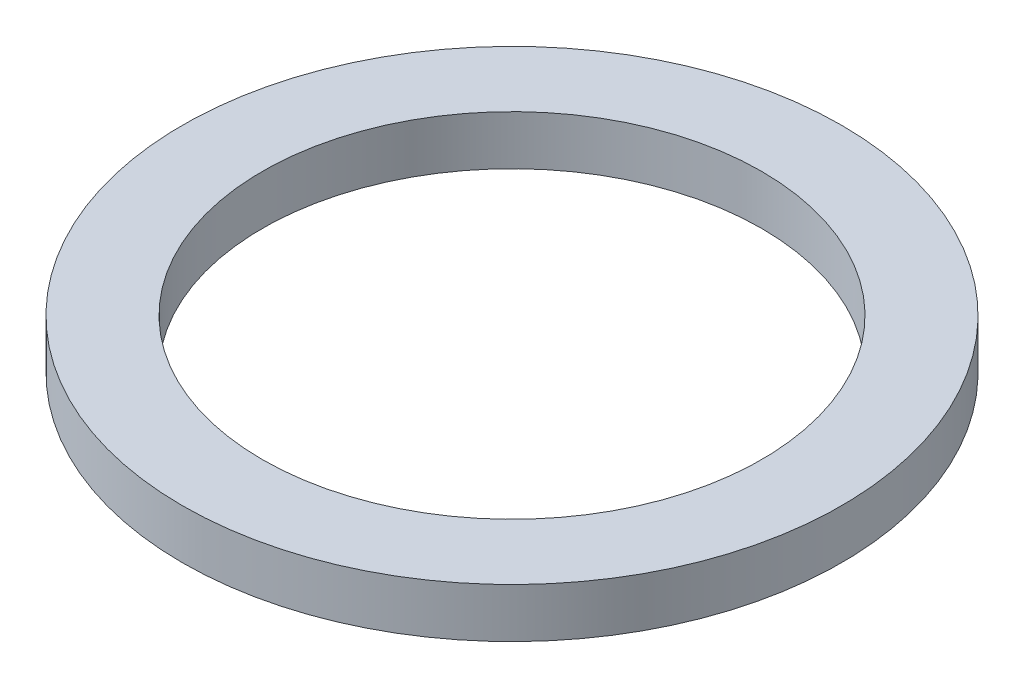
ISO-10303-21;
HEADER;
FILE_DESCRIPTION(('STEP AP214'),'2;1');
FILE_NAME('part.step','',(''),(''),'','','');
FILE_SCHEMA(('AUTOMOTIVE_DESIGN { 1 0 10303 214 1 1 1 1 }'));
ENDSEC;
DATA;
#1=APPLICATION_CONTEXT('core data for automotive mechanical design processes');
#2=APPLICATION_PROTOCOL_DEFINITION('international standard','automotive_design',2000,#1);
#3=PRODUCT_CONTEXT('',#1,'mechanical');
#4=PRODUCT('Part','Part','',(#3));
#5=PRODUCT_RELATED_PRODUCT_CATEGORY('part','',(#4));
#6=PRODUCT_DEFINITION_FORMATION('','',#4);
#7=PRODUCT_DEFINITION_CONTEXT('part definition',#1,'design');
#8=PRODUCT_DEFINITION('design','',#6,#7);
#9=PRODUCT_DEFINITION_SHAPE('','',#8);
#10=(LENGTH_UNIT() NAMED_UNIT(*) SI_UNIT(.MILLI.,.METRE.));
#11=(NAMED_UNIT(*) PLANE_ANGLE_UNIT() SI_UNIT($,.RADIAN.));
#12=(NAMED_UNIT(*) SI_UNIT($,.STERADIAN.) SOLID_ANGLE_UNIT());
#13=UNCERTAINTY_MEASURE_WITH_UNIT(LENGTH_MEASURE(1.E-05),#10,'distance_accuracy_value','');
#14=(GEOMETRIC_REPRESENTATION_CONTEXT(3) GLOBAL_UNCERTAINTY_ASSIGNED_CONTEXT((#13)) GLOBAL_UNIT_ASSIGNED_CONTEXT((#10,
#11,#12)) REPRESENTATION_CONTEXT('',''));
#15=CARTESIAN_POINT('',(0.,0.,0.));
#16=DIRECTION('',(0.,0.,1.));
#17=DIRECTION('',(1.,0.,0.));
#18=AXIS2_PLACEMENT_3D('',#15,#16,#17);
#19=CARTESIAN_POINT('',(0.,3.,0.));
#20=DIRECTION('',(0.,1.,0.));
#21=DIRECTION('',(0.,0.,1.));
#22=AXIS2_PLACEMENT_3D('',#19,#20,#21);
#23=PLANE('',#22);
#24=CARTESIAN_POINT('',(0.,3.,0.));
#25=DIRECTION('',(0.,1.,0.));
#26=DIRECTION('',(0.,0.,1.));
#27=AXIS2_PLACEMENT_3D('',#24,#25,#26);
#28=CIRCLE('',#27,20.);
#29=CARTESIAN_POINT('',(0.,3.,20.));
#30=VERTEX_POINT('',#29);
#31=EDGE_CURVE('E10',#30,#30,#28,.T.);
#32=ORIENTED_EDGE('',*,*,#31,.T.);
#33=EDGE_LOOP('',(#32));
#34=FACE_BOUND('',#33,.T.);
#35=CARTESIAN_POINT('',(0.,3.,0.));
#36=DIRECTION('',(0.,1.,0.));
#37=DIRECTION('',(0.,0.,1.));
#38=AXIS2_PLACEMENT_3D('',#35,#36,#37);
#39=CIRCLE('',#38,15.15);
#40=CARTESIAN_POINT('',(0.,3.,15.15));
#41=VERTEX_POINT('',#40);
#42=EDGE_CURVE('E50',#41,#41,#39,.T.);
#43=ORIENTED_EDGE('',*,*,#42,.F.);
#44=EDGE_LOOP('',(#43));
#45=FACE_BOUND('',#44,.T.);
#46=ADVANCED_FACE('F36',(#34,#45),#23,.T.);
#47=CARTESIAN_POINT('',(0.,0.,0.));
#48=DIRECTION('',(0.,1.,0.));
#49=DIRECTION('',(0.,0.,1.));
#50=AXIS2_PLACEMENT_3D('',#47,#48,#49);
#51=PLANE('',#50);
#52=CARTESIAN_POINT('',(0.,0.,0.));
#53=DIRECTION('',(0.,1.,0.));
#54=DIRECTION('',(0.,0.,1.));
#55=AXIS2_PLACEMENT_3D('',#52,#53,#54);
#56=CIRCLE('',#55,20.);
#57=CARTESIAN_POINT('',(0.,0.,20.));
#58=VERTEX_POINT('',#57);
#59=EDGE_CURVE('E40',#58,#58,#56,.T.);
#60=ORIENTED_EDGE('',*,*,#59,.F.);
#61=EDGE_LOOP('',(#60));
#62=FACE_BOUND('',#61,.T.);
#63=CARTESIAN_POINT('',(0.,0.,0.));
#64=DIRECTION('',(0.,1.,0.));
#65=DIRECTION('',(0.,0.,1.));
#66=AXIS2_PLACEMENT_3D('',#63,#64,#65);
#67=CIRCLE('',#66,15.15);
#68=CARTESIAN_POINT('',(0.,0.,15.15));
#69=VERTEX_POINT('',#68);
#70=EDGE_CURVE('E52',#69,#69,#67,.T.);
#71=ORIENTED_EDGE('',*,*,#70,.T.);
#72=EDGE_LOOP('',(#71));
#73=FACE_BOUND('',#72,.T.);
#74=ADVANCED_FACE('F63',(#62,#73),#51,.F.);
#75=CARTESIAN_POINT('',(0.,3.,0.));
#76=DIRECTION('',(0.,-1.,0.));
#77=DIRECTION('',(0.,0.,-1.));
#78=AXIS2_PLACEMENT_3D('',#75,#76,#77);
#79=CYLINDRICAL_SURFACE('',#78,20.);
#80=ORIENTED_EDGE('',*,*,#31,.F.);
#81=EDGE_LOOP('',(#80));
#82=FACE_BOUND('',#81,.T.);
#83=ORIENTED_EDGE('',*,*,#59,.T.);
#84=EDGE_LOOP('',(#83));
#85=FACE_BOUND('',#84,.T.);
#86=ADVANCED_FACE('F38',(#82,#85),#79,.T.);
#87=CARTESIAN_POINT('',(0.,3.,0.));
#88=DIRECTION('',(0.,-1.,0.));
#89=DIRECTION('',(0.,0.,-1.));
#90=AXIS2_PLACEMENT_3D('',#87,#88,#89);
#91=CYLINDRICAL_SURFACE('',#90,15.15);
#92=ORIENTED_EDGE('',*,*,#42,.T.);
#93=EDGE_LOOP('',(#92));
#94=FACE_BOUND('',#93,.T.);
#95=ORIENTED_EDGE('',*,*,#70,.F.);
#96=EDGE_LOOP('',(#95));
#97=FACE_BOUND('',#96,.T.);
#98=ADVANCED_FACE('F59',(#94,#97),#91,.F.);
#99=CLOSED_SHELL('',(#46,#74,#86,#98));
#100=MANIFOLD_SOLID_BREP('B2',#99);
#101=ADVANCED_BREP_SHAPE_REPRESENTATION('',(#18,#100),#14);
#102=SHAPE_DEFINITION_REPRESENTATION(#9,#101);
ENDSEC;
END-ISO-10303-21;
